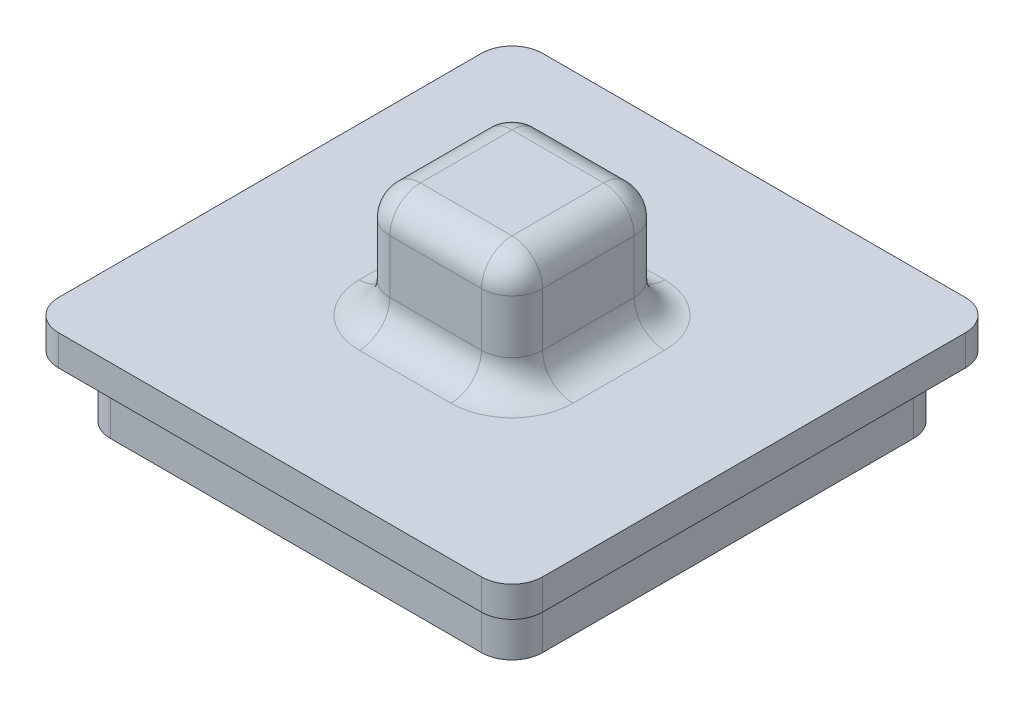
ISO-10303-21;
HEADER;
FILE_DESCRIPTION(('STEP AP214'),'2;1');
FILE_NAME('part.step','',(''),(''),'','','');
FILE_SCHEMA(('AUTOMOTIVE_DESIGN { 1 0 10303 214 1 1 1 1 }'));
ENDSEC;
DATA;
#1=APPLICATION_CONTEXT('core data for automotive mechanical design processes');
#2=APPLICATION_PROTOCOL_DEFINITION('international standard','automotive_design',2000,#1);
#3=PRODUCT_CONTEXT('',#1,'mechanical');
#4=PRODUCT('Part','Part','',(#3));
#5=PRODUCT_RELATED_PRODUCT_CATEGORY('part','',(#4));
#6=PRODUCT_DEFINITION_FORMATION('','',#4);
#7=PRODUCT_DEFINITION_CONTEXT('part definition',#1,'design');
#8=PRODUCT_DEFINITION('design','',#6,#7);
#9=PRODUCT_DEFINITION_SHAPE('','',#8);
#10=(LENGTH_UNIT() NAMED_UNIT(*) SI_UNIT(.MILLI.,.METRE.));
#11=(NAMED_UNIT(*) PLANE_ANGLE_UNIT() SI_UNIT($,.RADIAN.));
#12=(NAMED_UNIT(*) SI_UNIT($,.STERADIAN.) SOLID_ANGLE_UNIT());
#13=UNCERTAINTY_MEASURE_WITH_UNIT(LENGTH_MEASURE(1.E-05),#10,'distance_accuracy_value','');
#14=(GEOMETRIC_REPRESENTATION_CONTEXT(3) GLOBAL_UNCERTAINTY_ASSIGNED_CONTEXT((#13)) GLOBAL_UNIT_ASSIGNED_CONTEXT((#10,
#11,#12)) REPRESENTATION_CONTEXT('',''));
#15=CARTESIAN_POINT('',(0.,0.,0.));
#16=DIRECTION('',(0.,0.,1.));
#17=DIRECTION('',(1.,0.,0.));
#18=AXIS2_PLACEMENT_3D('',#15,#16,#17);
#19=CARTESIAN_POINT('',(0.,0.,0.));
#20=DIRECTION('',(0.,1.,0.));
#21=DIRECTION('',(0.,0.,1.));
#22=AXIS2_PLACEMENT_3D('',#19,#20,#21);
#23=PLANE('',#22);
#24=DIRECTION('',(1.,0.,0.));
#25=VECTOR('',#24,1.);
#26=CARTESIAN_POINT('',(-7.925,0.,7.925));
#27=LINE('',#26,#25);
#28=CARTESIAN_POINT('',(-6.925,0.,7.925));
#29=VERTEX_POINT('',#28);
#30=CARTESIAN_POINT('',(6.925,0.,7.925));
#31=VERTEX_POINT('',#30);
#32=EDGE_CURVE('E483',#29,#31,#27,.T.);
#33=ORIENTED_EDGE('',*,*,#32,.F.);
#34=CARTESIAN_POINT('',(-6.925,0.,6.925));
#35=DIRECTION('',(0.,1.,0.));
#36=DIRECTION('',(0.,0.,1.));
#37=AXIS2_PLACEMENT_3D('',#34,#35,#36);
#38=CIRCLE('',#37,1.);
#39=CARTESIAN_POINT('',(-7.925,0.,6.925));
#40=VERTEX_POINT('',#39);
#41=EDGE_CURVE('E377',#29,#40,#38,.F.);
#42=ORIENTED_EDGE('',*,*,#41,.T.);
#43=DIRECTION('',(0.,0.,1.));
#44=VECTOR('',#43,1.);
#45=CARTESIAN_POINT('',(-7.925,0.,-7.925));
#46=LINE('',#45,#44);
#47=CARTESIAN_POINT('',(-7.925,0.,-6.925));
#48=VERTEX_POINT('',#47);
#49=EDGE_CURVE('E496',#48,#40,#46,.T.);
#50=ORIENTED_EDGE('',*,*,#49,.F.);
#51=CARTESIAN_POINT('',(-6.925,0.,-6.925));
#52=DIRECTION('',(0.,1.,0.));
#53=DIRECTION('',(0.,0.,1.));
#54=AXIS2_PLACEMENT_3D('',#51,#52,#53);
#55=CIRCLE('',#54,1.);
#56=CARTESIAN_POINT('',(-6.925,0.,-7.925));
#57=VERTEX_POINT('',#56);
#58=EDGE_CURVE('E54',#48,#57,#55,.F.);
#59=ORIENTED_EDGE('',*,*,#58,.T.);
#60=DIRECTION('',(-1.,0.,0.));
#61=VECTOR('',#60,1.);
#62=CARTESIAN_POINT('',(-7.925,0.,-7.925));
#63=LINE('',#62,#61);
#64=CARTESIAN_POINT('',(6.925,0.,-7.925));
#65=VERTEX_POINT('',#64);
#66=EDGE_CURVE('E494',#65,#57,#63,.T.);
#67=ORIENTED_EDGE('',*,*,#66,.F.);
#68=CARTESIAN_POINT('',(6.925,0.,-6.925));
#69=DIRECTION('',(0.,1.,0.));
#70=DIRECTION('',(0.,0.,1.));
#71=AXIS2_PLACEMENT_3D('',#68,#69,#70);
#72=CIRCLE('',#71,1.);
#73=CARTESIAN_POINT('',(7.925,0.,-6.925));
#74=VERTEX_POINT('',#73);
#75=EDGE_CURVE('E62',#65,#74,#72,.F.);
#76=ORIENTED_EDGE('',*,*,#75,.T.);
#77=DIRECTION('',(0.,0.,-1.));
#78=VECTOR('',#77,1.);
#79=CARTESIAN_POINT('',(7.925,0.,-7.925));
#80=LINE('',#79,#78);
#81=CARTESIAN_POINT('',(7.925,0.,6.925));
#82=VERTEX_POINT('',#81);
#83=EDGE_CURVE('E491',#82,#74,#80,.T.);
#84=ORIENTED_EDGE('',*,*,#83,.F.);
#85=CARTESIAN_POINT('',(6.925,0.,6.925));
#86=DIRECTION('',(0.,1.,0.));
#87=DIRECTION('',(0.,0.,1.));
#88=AXIS2_PLACEMENT_3D('',#85,#86,#87);
#89=CIRCLE('',#88,1.);
#90=EDGE_CURVE('E373',#82,#31,#89,.F.);
#91=ORIENTED_EDGE('',*,*,#90,.T.);
#92=EDGE_LOOP('',(#33,#42,#50,#59,#67,#76,#84,#91));
#93=FACE_BOUND('',#92,.T.);
#94=DIRECTION('',(0.,0.,1.));
#95=VECTOR('',#94,1.);
#96=CARTESIAN_POINT('',(7.075,0.,7.075));
#97=LINE('',#96,#95);
#98=CARTESIAN_POINT('',(7.075,0.,-6.075));
#99=VERTEX_POINT('',#98);
#100=CARTESIAN_POINT('',(7.075,0.,6.075));
#101=VERTEX_POINT('',#100);
#102=EDGE_CURVE('E455',#99,#101,#97,.T.);
#103=ORIENTED_EDGE('',*,*,#102,.F.);
#104=CARTESIAN_POINT('',(6.075,0.,-6.075));
#105=DIRECTION('',(0.,1.,0.));
#106=DIRECTION('',(0.,0.,1.));
#107=AXIS2_PLACEMENT_3D('',#104,#105,#106);
#108=CIRCLE('',#107,1.);
#109=CARTESIAN_POINT('',(6.075,0.,-7.075));
#110=VERTEX_POINT('',#109);
#111=EDGE_CURVE('E395',#99,#110,#108,.T.);
#112=ORIENTED_EDGE('',*,*,#111,.T.);
#113=DIRECTION('',(1.,0.,0.));
#114=VECTOR('',#113,1.);
#115=CARTESIAN_POINT('',(-7.075,0.,-7.075));
#116=LINE('',#115,#114);
#117=CARTESIAN_POINT('',(-6.075,0.,-7.075));
#118=VERTEX_POINT('',#117);
#119=EDGE_CURVE('E475',#118,#110,#116,.T.);
#120=ORIENTED_EDGE('',*,*,#119,.F.);
#121=CARTESIAN_POINT('',(-6.075,0.,-6.075));
#122=DIRECTION('',(0.,1.,0.));
#123=DIRECTION('',(0.,0.,1.));
#124=AXIS2_PLACEMENT_3D('',#121,#122,#123);
#125=CIRCLE('',#124,1.);
#126=CARTESIAN_POINT('',(-7.075,0.,-6.075));
#127=VERTEX_POINT('',#126);
#128=EDGE_CURVE('E393',#118,#127,#125,.T.);
#129=ORIENTED_EDGE('',*,*,#128,.T.);
#130=DIRECTION('',(0.,0.,-1.));
#131=VECTOR('',#130,1.);
#132=CARTESIAN_POINT('',(-7.075,0.,7.075));
#133=LINE('',#132,#131);
#134=CARTESIAN_POINT('',(-7.075,0.,6.075));
#135=VERTEX_POINT('',#134);
#136=EDGE_CURVE('E467',#135,#127,#133,.T.);
#137=ORIENTED_EDGE('',*,*,#136,.F.);
#138=CARTESIAN_POINT('',(-6.075,0.,6.075));
#139=DIRECTION('',(0.,1.,0.));
#140=DIRECTION('',(0.,0.,1.));
#141=AXIS2_PLACEMENT_3D('',#138,#139,#140);
#142=CIRCLE('',#141,1.);
#143=CARTESIAN_POINT('',(-6.075,0.,7.075));
#144=VERTEX_POINT('',#143);
#145=EDGE_CURVE('E11',#135,#144,#142,.T.);
#146=ORIENTED_EDGE('',*,*,#145,.T.);
#147=DIRECTION('',(-1.,0.,0.));
#148=VECTOR('',#147,1.);
#149=CARTESIAN_POINT('',(-7.075,0.,7.075));
#150=LINE('',#149,#148);
#151=CARTESIAN_POINT('',(6.075,0.,7.075));
#152=VERTEX_POINT('',#151);
#153=EDGE_CURVE('E461',#152,#144,#150,.T.);
#154=ORIENTED_EDGE('',*,*,#153,.F.);
#155=CARTESIAN_POINT('',(6.075,0.,6.075));
#156=DIRECTION('',(0.,1.,0.));
#157=DIRECTION('',(0.,0.,1.));
#158=AXIS2_PLACEMENT_3D('',#155,#156,#157);
#159=CIRCLE('',#158,1.);
#160=EDGE_CURVE('E46',#152,#101,#159,.T.);
#161=ORIENTED_EDGE('',*,*,#160,.T.);
#162=EDGE_LOOP('',(#103,#112,#120,#129,#137,#146,#154,#161));
#163=FACE_BOUND('',#162,.T.);
#164=ADVANCED_FACE('F37',(#93,#163),#23,.F.);
#165=CARTESIAN_POINT('',(7.925,1.,-7.925));
#166=DIRECTION('',(-1.,0.,0.));
#167=DIRECTION('',(0.,0.,1.));
#168=AXIS2_PLACEMENT_3D('',#165,#166,#167);
#169=PLANE('',#168);
#170=ORIENTED_EDGE('',*,*,#83,.T.);
#171=DIRECTION('',(0.,-1.,0.));
#172=VECTOR('',#171,1.);
#173=CARTESIAN_POINT('',(7.925,1.,-6.925));
#174=LINE('',#173,#172);
#175=CARTESIAN_POINT('',(7.925,1.,-6.925));
#176=VERTEX_POINT('',#175);
#177=EDGE_CURVE('E391',#74,#176,#174,.F.);
#178=ORIENTED_EDGE('',*,*,#177,.T.);
#179=DIRECTION('',(0.,0.,-1.));
#180=VECTOR('',#179,1.);
#181=CARTESIAN_POINT('',(7.925,1.,-7.925));
#182=LINE('',#181,#180);
#183=CARTESIAN_POINT('',(7.925,1.,6.925));
#184=VERTEX_POINT('',#183);
#185=EDGE_CURVE('E479',#184,#176,#182,.T.);
#186=ORIENTED_EDGE('',*,*,#185,.F.);
#187=DIRECTION('',(0.,-1.,0.));
#188=VECTOR('',#187,1.);
#189=CARTESIAN_POINT('',(7.925,1.,6.925));
#190=LINE('',#189,#188);
#191=EDGE_CURVE('E388',#184,#82,#190,.T.);
#192=ORIENTED_EDGE('',*,*,#191,.T.);
#193=EDGE_LOOP('',(#170,#178,#186,#192));
#194=FACE_BOUND('',#193,.T.);
#195=ADVANCED_FACE('F548',(#194),#169,.F.);
#196=CARTESIAN_POINT('',(-7.925,1.,-7.925));
#197=DIRECTION('',(0.,0.,1.));
#198=DIRECTION('',(1.,0.,0.));
#199=AXIS2_PLACEMENT_3D('',#196,#197,#198);
#200=PLANE('',#199);
#201=ORIENTED_EDGE('',*,*,#66,.T.);
#202=DIRECTION('',(0.,-1.,0.));
#203=VECTOR('',#202,1.);
#204=CARTESIAN_POINT('',(-6.925,1.,-7.925));
#205=LINE('',#204,#203);
#206=CARTESIAN_POINT('',(-6.925,1.,-7.925));
#207=VERTEX_POINT('',#206);
#208=EDGE_CURVE('E386',#57,#207,#205,.F.);
#209=ORIENTED_EDGE('',*,*,#208,.T.);
#210=DIRECTION('',(-1.,0.,0.));
#211=VECTOR('',#210,1.);
#212=CARTESIAN_POINT('',(-7.925,1.,-7.925));
#213=LINE('',#212,#211);
#214=CARTESIAN_POINT('',(6.925,1.,-7.925));
#215=VERTEX_POINT('',#214);
#216=EDGE_CURVE('E482',#215,#207,#213,.T.);
#217=ORIENTED_EDGE('',*,*,#216,.F.);
#218=DIRECTION('',(0.,-1.,0.));
#219=VECTOR('',#218,1.);
#220=CARTESIAN_POINT('',(6.925,1.,-7.925));
#221=LINE('',#220,#219);
#222=EDGE_CURVE('E384',#215,#65,#221,.T.);
#223=ORIENTED_EDGE('',*,*,#222,.T.);
#224=EDGE_LOOP('',(#201,#209,#217,#223));
#225=FACE_BOUND('',#224,.T.);
#226=ADVANCED_FACE('F553',(#225),#200,.F.);
#227=CARTESIAN_POINT('',(-7.925,1.,-7.925));
#228=DIRECTION('',(1.,0.,0.));
#229=DIRECTION('',(0.,0.,-1.));
#230=AXIS2_PLACEMENT_3D('',#227,#228,#229);
#231=PLANE('',#230);
#232=ORIENTED_EDGE('',*,*,#49,.T.);
#233=DIRECTION('',(0.,-1.,0.));
#234=VECTOR('',#233,1.);
#235=CARTESIAN_POINT('',(-7.925,1.,6.925));
#236=LINE('',#235,#234);
#237=CARTESIAN_POINT('',(-7.925,1.,6.925));
#238=VERTEX_POINT('',#237);
#239=EDGE_CURVE('E382',#40,#238,#236,.F.);
#240=ORIENTED_EDGE('',*,*,#239,.T.);
#241=DIRECTION('',(0.,0.,1.));
#242=VECTOR('',#241,1.);
#243=CARTESIAN_POINT('',(-7.925,1.,-7.925));
#244=LINE('',#243,#242);
#245=CARTESIAN_POINT('',(-7.925,1.,-6.925));
#246=VERTEX_POINT('',#245);
#247=EDGE_CURVE('E486',#246,#238,#244,.T.);
#248=ORIENTED_EDGE('',*,*,#247,.F.);
#249=DIRECTION('',(0.,-1.,0.));
#250=VECTOR('',#249,1.);
#251=CARTESIAN_POINT('',(-7.925,1.,-6.925));
#252=LINE('',#251,#250);
#253=EDGE_CURVE('E379',#246,#48,#252,.T.);
#254=ORIENTED_EDGE('',*,*,#253,.T.);
#255=EDGE_LOOP('',(#232,#240,#248,#254));
#256=FACE_BOUND('',#255,.T.);
#257=ADVANCED_FACE('F564',(#256),#231,.F.);
#258=CARTESIAN_POINT('',(-7.925,1.,7.925));
#259=DIRECTION('',(0.,0.,-1.));
#260=DIRECTION('',(-1.,0.,0.));
#261=AXIS2_PLACEMENT_3D('',#258,#259,#260);
#262=PLANE('',#261);
#263=DIRECTION('',(1.,0.,0.));
#264=VECTOR('',#263,1.);
#265=CARTESIAN_POINT('',(-7.925,1.,7.925));
#266=LINE('',#265,#264);
#267=CARTESIAN_POINT('',(-6.925,1.,7.925));
#268=VERTEX_POINT('',#267);
#269=CARTESIAN_POINT('',(6.925,1.,7.925));
#270=VERTEX_POINT('',#269);
#271=EDGE_CURVE('E268',#268,#270,#266,.T.);
#272=ORIENTED_EDGE('',*,*,#271,.F.);
#273=DIRECTION('',(0.,-1.,0.));
#274=VECTOR('',#273,1.);
#275=CARTESIAN_POINT('',(-6.925,1.,7.925));
#276=LINE('',#275,#274);
#277=EDGE_CURVE('E370',#268,#29,#276,.T.);
#278=ORIENTED_EDGE('',*,*,#277,.T.);
#279=ORIENTED_EDGE('',*,*,#32,.T.);
#280=DIRECTION('',(0.,-1.,0.));
#281=VECTOR('',#280,1.);
#282=CARTESIAN_POINT('',(6.925,1.,7.925));
#283=LINE('',#282,#281);
#284=EDGE_CURVE('E368',#31,#270,#283,.F.);
#285=ORIENTED_EDGE('',*,*,#284,.T.);
#286=EDGE_LOOP('',(#272,#278,#279,#285));
#287=FACE_BOUND('',#286,.T.);
#288=ADVANCED_FACE('F561',(#287),#262,.F.);
#289=CARTESIAN_POINT('',(0.,1.,0.));
#290=DIRECTION('',(0.,1.,0.));
#291=DIRECTION('',(0.,0.,1.));
#292=AXIS2_PLACEMENT_3D('',#289,#290,#291);
#293=PLANE('',#292);
#294=CARTESIAN_POINT('',(-1.5,1.,-1.5));
#295=DIRECTION('',(0.,1.,0.));
#296=DIRECTION('',(0.,0.,1.));
#297=AXIS2_PLACEMENT_3D('',#294,#295,#296);
#298=CIRCLE('',#297,2.);
#299=CARTESIAN_POINT('',(-1.5,1.,-3.5));
#300=VERTEX_POINT('',#299);
#301=CARTESIAN_POINT('',(-3.5,1.,-1.5));
#302=VERTEX_POINT('',#301);
#303=EDGE_CURVE('E286',#300,#302,#298,.T.);
#304=ORIENTED_EDGE('',*,*,#303,.F.);
#305=DIRECTION('',(-1.,0.,0.));
#306=VECTOR('',#305,1.);
#307=CARTESIAN_POINT('',(0.,1.,-3.5));
#308=LINE('',#307,#306);
#309=CARTESIAN_POINT('',(1.5,1.,-3.5));
#310=VERTEX_POINT('',#309);
#311=EDGE_CURVE('E244',#300,#310,#308,.F.);
#312=ORIENTED_EDGE('',*,*,#311,.T.);
#313=CARTESIAN_POINT('',(1.5,1.,-1.5));
#314=DIRECTION('',(0.,1.,0.));
#315=DIRECTION('',(0.,0.,1.));
#316=AXIS2_PLACEMENT_3D('',#313,#314,#315);
#317=CIRCLE('',#316,2.);
#318=CARTESIAN_POINT('',(3.5,1.,-1.5));
#319=VERTEX_POINT('',#318);
#320=EDGE_CURVE('E300',#319,#310,#317,.T.);
#321=ORIENTED_EDGE('',*,*,#320,.F.);
#322=DIRECTION('',(0.,0.,-1.));
#323=VECTOR('',#322,1.);
#324=CARTESIAN_POINT('',(3.5,1.,0.));
#325=LINE('',#324,#323);
#326=CARTESIAN_POINT('',(3.5,1.,1.5));
#327=VERTEX_POINT('',#326);
#328=EDGE_CURVE('E298',#319,#327,#325,.F.);
#329=ORIENTED_EDGE('',*,*,#328,.T.);
#330=CARTESIAN_POINT('',(1.5,1.,1.5));
#331=DIRECTION('',(0.,1.,0.));
#332=DIRECTION('',(0.,0.,1.));
#333=AXIS2_PLACEMENT_3D('',#330,#331,#332);
#334=CIRCLE('',#333,2.);
#335=CARTESIAN_POINT('',(1.5,1.,3.5));
#336=VERTEX_POINT('',#335);
#337=EDGE_CURVE('E295',#336,#327,#334,.T.);
#338=ORIENTED_EDGE('',*,*,#337,.F.);
#339=DIRECTION('',(1.,0.,0.));
#340=VECTOR('',#339,1.);
#341=CARTESIAN_POINT('',(0.,1.,3.5));
#342=LINE('',#341,#340);
#343=CARTESIAN_POINT('',(-1.5,1.,3.5));
#344=VERTEX_POINT('',#343);
#345=EDGE_CURVE('E293',#336,#344,#342,.F.);
#346=ORIENTED_EDGE('',*,*,#345,.T.);
#347=CARTESIAN_POINT('',(-1.5,1.,1.5));
#348=DIRECTION('',(0.,1.,0.));
#349=DIRECTION('',(0.,0.,1.));
#350=AXIS2_PLACEMENT_3D('',#347,#348,#349);
#351=CIRCLE('',#350,2.);
#352=CARTESIAN_POINT('',(-3.5,1.,1.5));
#353=VERTEX_POINT('',#352);
#354=EDGE_CURVE('E290',#353,#344,#351,.T.);
#355=ORIENTED_EDGE('',*,*,#354,.F.);
#356=DIRECTION('',(0.,0.,1.));
#357=VECTOR('',#356,1.);
#358=CARTESIAN_POINT('',(-3.5,1.,0.));
#359=LINE('',#358,#357);
#360=EDGE_CURVE('E288',#353,#302,#359,.F.);
#361=ORIENTED_EDGE('',*,*,#360,.T.);
#362=EDGE_LOOP('',(#304,#312,#321,#329,#338,#346,#355,#361));
#363=FACE_BOUND('',#362,.T.);
#364=ORIENTED_EDGE('',*,*,#247,.T.);
#365=CARTESIAN_POINT('',(-6.925,1.,6.925));
#366=DIRECTION('',(0.,1.,0.));
#367=DIRECTION('',(0.,0.,1.));
#368=AXIS2_PLACEMENT_3D('',#365,#366,#367);
#369=CIRCLE('',#368,1.);
#370=EDGE_CURVE('E284',#238,#268,#369,.T.);
#371=ORIENTED_EDGE('',*,*,#370,.T.);
#372=ORIENTED_EDGE('',*,*,#271,.T.);
#373=CARTESIAN_POINT('',(6.925,1.,6.925));
#374=DIRECTION('',(0.,1.,0.));
#375=DIRECTION('',(0.,0.,1.));
#376=AXIS2_PLACEMENT_3D('',#373,#374,#375);
#377=CIRCLE('',#376,1.);
#378=EDGE_CURVE('E274',#270,#184,#377,.T.);
#379=ORIENTED_EDGE('',*,*,#378,.T.);
#380=ORIENTED_EDGE('',*,*,#185,.T.);
#381=CARTESIAN_POINT('',(6.925,1.,-6.925));
#382=DIRECTION('',(0.,1.,0.));
#383=DIRECTION('',(0.,0.,1.));
#384=AXIS2_PLACEMENT_3D('',#381,#382,#383);
#385=CIRCLE('',#384,1.);
#386=EDGE_CURVE('E276',#176,#215,#385,.T.);
#387=ORIENTED_EDGE('',*,*,#386,.T.);
#388=ORIENTED_EDGE('',*,*,#216,.T.);
#389=CARTESIAN_POINT('',(-6.925,1.,-6.925));
#390=DIRECTION('',(0.,1.,0.));
#391=DIRECTION('',(0.,0.,1.));
#392=AXIS2_PLACEMENT_3D('',#389,#390,#391);
#393=CIRCLE('',#392,1.);
#394=EDGE_CURVE('E282',#207,#246,#393,.T.);
#395=ORIENTED_EDGE('',*,*,#394,.T.);
#396=EDGE_LOOP('',(#364,#371,#372,#379,#380,#387,#388,#395));
#397=FACE_BOUND('',#396,.T.);
#398=ADVANCED_FACE('F519',(#363,#397),#293,.T.);
#399=CARTESIAN_POINT('',(7.075,-2.,7.075));
#400=DIRECTION('',(-1.,0.,0.));
#401=DIRECTION('',(0.,0.,1.));
#402=AXIS2_PLACEMENT_3D('',#399,#400,#401);
#403=PLANE('',#402);
#404=DIRECTION('',(0.,0.,1.));
#405=VECTOR('',#404,1.);
#406=CARTESIAN_POINT('',(7.075,-2.,7.075));
#407=LINE('',#406,#405);
#408=CARTESIAN_POINT('',(7.075,-2.,-6.075));
#409=VERTEX_POINT('',#408);
#410=CARTESIAN_POINT('',(7.075,-2.,6.075));
#411=VERTEX_POINT('',#410);
#412=EDGE_CURVE('E478',#409,#411,#407,.T.);
#413=ORIENTED_EDGE('',*,*,#412,.F.);
#414=DIRECTION('',(0.,1.,0.));
#415=VECTOR('',#414,1.);
#416=CARTESIAN_POINT('',(7.075,-2.,-6.075));
#417=LINE('',#416,#415);
#418=EDGE_CURVE('E360',#409,#99,#417,.T.);
#419=ORIENTED_EDGE('',*,*,#418,.T.);
#420=ORIENTED_EDGE('',*,*,#102,.T.);
#421=DIRECTION('',(0.,1.,0.));
#422=VECTOR('',#421,1.);
#423=CARTESIAN_POINT('',(7.075,-2.,6.075));
#424=LINE('',#423,#422);
#425=EDGE_CURVE('E358',#101,#411,#424,.F.);
#426=ORIENTED_EDGE('',*,*,#425,.T.);
#427=EDGE_LOOP('',(#413,#419,#420,#426));
#428=FACE_BOUND('',#427,.T.);
#429=ADVANCED_FACE('F666',(#428),#403,.F.);
#430=CARTESIAN_POINT('',(-7.075,-2.,7.075));
#431=DIRECTION('',(0.,0.,-1.));
#432=DIRECTION('',(-1.,0.,0.));
#433=AXIS2_PLACEMENT_3D('',#430,#431,#432);
#434=PLANE('',#433);
#435=DIRECTION('',(-1.,0.,0.));
#436=VECTOR('',#435,1.);
#437=CARTESIAN_POINT('',(-7.075,-2.,7.075));
#438=LINE('',#437,#436);
#439=CARTESIAN_POINT('',(6.075,-2.,7.075));
#440=VERTEX_POINT('',#439);
#441=CARTESIAN_POINT('',(-6.075,-2.,7.075));
#442=VERTEX_POINT('',#441);
#443=EDGE_CURVE('E1068',#440,#442,#438,.T.);
#444=ORIENTED_EDGE('',*,*,#443,.F.);
#445=DIRECTION('',(0.,1.,0.));
#446=VECTOR('',#445,1.);
#447=CARTESIAN_POINT('',(6.075,-2.,7.075));
#448=LINE('',#447,#446);
#449=EDGE_CURVE('E365',#440,#152,#448,.T.);
#450=ORIENTED_EDGE('',*,*,#449,.T.);
#451=ORIENTED_EDGE('',*,*,#153,.T.);
#452=DIRECTION('',(0.,1.,0.));
#453=VECTOR('',#452,1.);
#454=CARTESIAN_POINT('',(-6.075,-2.,7.075));
#455=LINE('',#454,#453);
#456=EDGE_CURVE('E363',#144,#442,#455,.F.);
#457=ORIENTED_EDGE('',*,*,#456,.T.);
#458=EDGE_LOOP('',(#444,#450,#451,#457));
#459=FACE_BOUND('',#458,.T.);
#460=ADVANCED_FACE('F670',(#459),#434,.F.);
#461=CARTESIAN_POINT('',(-7.075,-2.,7.075));
#462=DIRECTION('',(1.,0.,0.));
#463=DIRECTION('',(0.,0.,-1.));
#464=AXIS2_PLACEMENT_3D('',#461,#462,#463);
#465=PLANE('',#464);
#466=ORIENTED_EDGE('',*,*,#136,.T.);
#467=DIRECTION('',(0.,1.,0.));
#468=VECTOR('',#467,1.);
#469=CARTESIAN_POINT('',(-7.075,-2.,-6.075));
#470=LINE('',#469,#468);
#471=CARTESIAN_POINT('',(-7.075,-2.,-6.075));
#472=VERTEX_POINT('',#471);
#473=EDGE_CURVE('E348',#127,#472,#470,.F.);
#474=ORIENTED_EDGE('',*,*,#473,.T.);
#475=DIRECTION('',(0.,0.,-1.));
#476=VECTOR('',#475,1.);
#477=CARTESIAN_POINT('',(-7.075,-2.,7.075));
#478=LINE('',#477,#476);
#479=CARTESIAN_POINT('',(-7.075,-2.,6.075));
#480=VERTEX_POINT('',#479);
#481=EDGE_CURVE('E1061',#480,#472,#478,.T.);
#482=ORIENTED_EDGE('',*,*,#481,.F.);
#483=DIRECTION('',(0.,1.,0.));
#484=VECTOR('',#483,1.);
#485=CARTESIAN_POINT('',(-7.075,-2.,6.075));
#486=LINE('',#485,#484);
#487=EDGE_CURVE('E345',#480,#135,#486,.T.);
#488=ORIENTED_EDGE('',*,*,#487,.T.);
#489=EDGE_LOOP('',(#466,#474,#482,#488));
#490=FACE_BOUND('',#489,.T.);
#491=ADVANCED_FACE('F674',(#490),#465,.F.);
#492=CARTESIAN_POINT('',(-7.075,-2.,-7.075));
#493=DIRECTION('',(0.,0.,1.));
#494=DIRECTION('',(1.,0.,0.));
#495=AXIS2_PLACEMENT_3D('',#492,#493,#494);
#496=PLANE('',#495);
#497=DIRECTION('',(1.,0.,0.));
#498=VECTOR('',#497,1.);
#499=CARTESIAN_POINT('',(-7.075,-2.,-7.075));
#500=LINE('',#499,#498);
#501=CARTESIAN_POINT('',(-6.075,-2.,-7.075));
#502=VERTEX_POINT('',#501);
#503=CARTESIAN_POINT('',(6.075,-2.,-7.075));
#504=VERTEX_POINT('',#503);
#505=EDGE_CURVE('E470',#502,#504,#500,.T.);
#506=ORIENTED_EDGE('',*,*,#505,.F.);
#507=DIRECTION('',(0.,1.,0.));
#508=VECTOR('',#507,1.);
#509=CARTESIAN_POINT('',(-6.075,-2.,-7.075));
#510=LINE('',#509,#508);
#511=EDGE_CURVE('E342',#502,#118,#510,.T.);
#512=ORIENTED_EDGE('',*,*,#511,.T.);
#513=ORIENTED_EDGE('',*,*,#119,.T.);
#514=DIRECTION('',(0.,1.,0.));
#515=VECTOR('',#514,1.);
#516=CARTESIAN_POINT('',(6.075,-2.,-7.075));
#517=LINE('',#516,#515);
#518=EDGE_CURVE('E340',#110,#504,#517,.F.);
#519=ORIENTED_EDGE('',*,*,#518,.T.);
#520=EDGE_LOOP('',(#506,#512,#513,#519));
#521=FACE_BOUND('',#520,.T.);
#522=ADVANCED_FACE('F681',(#521),#496,.F.);
#523=CARTESIAN_POINT('',(0.,-2.,0.));
#524=DIRECTION('',(0.,-1.,0.));
#525=DIRECTION('',(0.,0.,-1.));
#526=AXIS2_PLACEMENT_3D('',#523,#524,#525);
#527=PLANE('',#526);
#528=ORIENTED_EDGE('',*,*,#481,.T.);
#529=CARTESIAN_POINT('',(-6.075,-2.,-6.075));
#530=DIRECTION('',(0.,-1.,0.));
#531=DIRECTION('',(0.,0.,-1.));
#532=AXIS2_PLACEMENT_3D('',#529,#530,#531);
#533=CIRCLE('',#532,1.);
#534=EDGE_CURVE('E356',#472,#502,#533,.T.);
#535=ORIENTED_EDGE('',*,*,#534,.T.);
#536=ORIENTED_EDGE('',*,*,#505,.T.);
#537=CARTESIAN_POINT('',(6.075,-2.,-6.075));
#538=DIRECTION('',(0.,-1.,0.));
#539=DIRECTION('',(0.,0.,-1.));
#540=AXIS2_PLACEMENT_3D('',#537,#538,#539);
#541=CIRCLE('',#540,1.);
#542=EDGE_CURVE('E354',#504,#409,#541,.T.);
#543=ORIENTED_EDGE('',*,*,#542,.T.);
#544=ORIENTED_EDGE('',*,*,#412,.T.);
#545=CARTESIAN_POINT('',(6.075,-2.,6.075));
#546=DIRECTION('',(0.,-1.,0.));
#547=DIRECTION('',(0.,0.,-1.));
#548=AXIS2_PLACEMENT_3D('',#545,#546,#547);
#549=CIRCLE('',#548,1.);
#550=EDGE_CURVE('E352',#411,#440,#549,.T.);
#551=ORIENTED_EDGE('',*,*,#550,.T.);
#552=ORIENTED_EDGE('',*,*,#443,.T.);
#553=CARTESIAN_POINT('',(-6.075,-2.,6.075));
#554=DIRECTION('',(0.,-1.,0.));
#555=DIRECTION('',(0.,0.,-1.));
#556=AXIS2_PLACEMENT_3D('',#553,#554,#555);
#557=CIRCLE('',#556,1.);
#558=EDGE_CURVE('E350',#442,#480,#557,.T.);
#559=ORIENTED_EDGE('',*,*,#558,.T.);
#560=EDGE_LOOP('',(#528,#535,#536,#543,#544,#551,#552,#559));
#561=FACE_BOUND('',#560,.T.);
#562=ADVANCED_FACE('F685',(#561),#527,.T.);
#563=CARTESIAN_POINT('',(2.5,4.75,-2.5));
#564=DIRECTION('',(-1.,0.,0.));
#565=DIRECTION('',(0.,0.,1.));
#566=AXIS2_PLACEMENT_3D('',#563,#564,#565);
#567=PLANE('',#566);
#568=DIRECTION('',(0.,0.,-1.));
#569=VECTOR('',#568,1.);
#570=CARTESIAN_POINT('',(2.5,2.,-2.5));
#571=LINE('',#570,#569);
#572=CARTESIAN_POINT('',(2.5,2.,1.5));
#573=VERTEX_POINT('',#572);
#574=CARTESIAN_POINT('',(2.5,2.,-1.5));
#575=VERTEX_POINT('',#574);
#576=EDGE_CURVE('E308',#573,#575,#571,.T.);
#577=ORIENTED_EDGE('',*,*,#576,.T.);
#578=DIRECTION('',(0.,-1.,0.));
#579=VECTOR('',#578,1.);
#580=CARTESIAN_POINT('',(2.5,4.75,-1.5));
#581=LINE('',#580,#579);
#582=CARTESIAN_POINT('',(2.5,3.75,-1.5));
#583=VERTEX_POINT('',#582);
#584=EDGE_CURVE('E310',#575,#583,#581,.F.);
#585=ORIENTED_EDGE('',*,*,#584,.T.);
#586=DIRECTION('',(0.,0.,-1.));
#587=VECTOR('',#586,1.);
#588=CARTESIAN_POINT('',(2.5,3.75,2.5));
#589=LINE('',#588,#587);
#590=CARTESIAN_POINT('',(2.5,3.75,1.5));
#591=VERTEX_POINT('',#590);
#592=EDGE_CURVE('E306',#583,#591,#589,.F.);
#593=ORIENTED_EDGE('',*,*,#592,.T.);
#594=DIRECTION('',(0.,-1.,0.));
#595=VECTOR('',#594,1.);
#596=CARTESIAN_POINT('',(2.5,4.75,1.5));
#597=LINE('',#596,#595);
#598=EDGE_CURVE('E304',#591,#573,#597,.T.);
#599=ORIENTED_EDGE('',*,*,#598,.T.);
#600=EDGE_LOOP('',(#577,#585,#593,#599));
#601=FACE_BOUND('',#600,.T.);
#602=ADVANCED_FACE('F689',(#601),#567,.F.);
#603=CARTESIAN_POINT('',(-2.5,4.75,-2.5));
#604=DIRECTION('',(0.,0.,1.));
#605=DIRECTION('',(1.,0.,0.));
#606=AXIS2_PLACEMENT_3D('',#603,#604,#605);
#607=PLANE('',#606);
#608=DIRECTION('',(0.,-1.,0.));
#609=VECTOR('',#608,1.);
#610=CARTESIAN_POINT('',(1.5,4.75,-2.5));
#611=LINE('',#610,#609);
#612=CARTESIAN_POINT('',(1.5,3.75,-2.5));
#613=VERTEX_POINT('',#612);
#614=CARTESIAN_POINT('',(1.5,2.,-2.5));
#615=VERTEX_POINT('',#614);
#616=EDGE_CURVE('E272',#613,#615,#611,.T.);
#617=ORIENTED_EDGE('',*,*,#616,.T.);
#618=DIRECTION('',(-1.,0.,0.));
#619=VECTOR('',#618,1.);
#620=CARTESIAN_POINT('',(-2.5,2.,-2.5));
#621=LINE('',#620,#619);
#622=CARTESIAN_POINT('',(-1.5,2.,-2.5));
#623=VERTEX_POINT('',#622);
#624=EDGE_CURVE('E242',#615,#623,#621,.T.);
#625=ORIENTED_EDGE('',*,*,#624,.T.);
#626=DIRECTION('',(0.,-1.,0.));
#627=VECTOR('',#626,1.);
#628=CARTESIAN_POINT('',(-1.5,4.75,-2.5));
#629=LINE('',#628,#627);
#630=CARTESIAN_POINT('',(-1.5,3.75,-2.5));
#631=VERTEX_POINT('',#630);
#632=EDGE_CURVE('E261',#623,#631,#629,.F.);
#633=ORIENTED_EDGE('',*,*,#632,.T.);
#634=DIRECTION('',(-1.,0.,0.));
#635=VECTOR('',#634,1.);
#636=CARTESIAN_POINT('',(2.5,3.75,-2.5));
#637=LINE('',#636,#635);
#638=EDGE_CURVE('E267',#631,#613,#637,.F.);
#639=ORIENTED_EDGE('',*,*,#638,.T.);
#640=EDGE_LOOP('',(#617,#625,#633,#639));
#641=FACE_BOUND('',#640,.T.);
#642=ADVANCED_FACE('F270',(#641),#607,.F.);
#643=CARTESIAN_POINT('',(-2.5,4.75,-2.5));
#644=DIRECTION('',(1.,0.,0.));
#645=DIRECTION('',(0.,0.,-1.));
#646=AXIS2_PLACEMENT_3D('',#643,#644,#645);
#647=PLANE('',#646);
#648=DIRECTION('',(0.,0.,1.));
#649=VECTOR('',#648,1.);
#650=CARTESIAN_POINT('',(-2.5,3.75,-2.5));
#651=LINE('',#650,#649);
#652=CARTESIAN_POINT('',(-2.5,3.75,1.5));
#653=VERTEX_POINT('',#652);
#654=CARTESIAN_POINT('',(-2.5,3.75,-1.5));
#655=VERTEX_POINT('',#654);
#656=EDGE_CURVE('E335',#653,#655,#651,.F.);
#657=ORIENTED_EDGE('',*,*,#656,.T.);
#658=DIRECTION('',(0.,-1.,0.));
#659=VECTOR('',#658,1.);
#660=CARTESIAN_POINT('',(-2.5,4.75,-1.5));
#661=LINE('',#660,#659);
#662=CARTESIAN_POINT('',(-2.5,2.,-1.5));
#663=VERTEX_POINT('',#662);
#664=EDGE_CURVE('E337',#655,#663,#661,.T.);
#665=ORIENTED_EDGE('',*,*,#664,.T.);
#666=DIRECTION('',(0.,0.,1.));
#667=VECTOR('',#666,1.);
#668=CARTESIAN_POINT('',(-2.5,2.,-2.5));
#669=LINE('',#668,#667);
#670=CARTESIAN_POINT('',(-2.5,2.,1.5));
#671=VERTEX_POINT('',#670);
#672=EDGE_CURVE('E331',#663,#671,#669,.T.);
#673=ORIENTED_EDGE('',*,*,#672,.T.);
#674=DIRECTION('',(0.,-1.,0.));
#675=VECTOR('',#674,1.);
#676=CARTESIAN_POINT('',(-2.5,4.75,1.5));
#677=LINE('',#676,#675);
#678=EDGE_CURVE('E333',#671,#653,#677,.F.);
#679=ORIENTED_EDGE('',*,*,#678,.T.);
#680=EDGE_LOOP('',(#657,#665,#673,#679));
#681=FACE_BOUND('',#680,.T.);
#682=ADVANCED_FACE('F527',(#681),#647,.F.);
#683=CARTESIAN_POINT('',(-2.5,4.75,2.5));
#684=DIRECTION('',(0.,0.,-1.));
#685=DIRECTION('',(-1.,0.,0.));
#686=AXIS2_PLACEMENT_3D('',#683,#684,#685);
#687=PLANE('',#686);
#688=DIRECTION('',(0.,-1.,0.));
#689=VECTOR('',#688,1.);
#690=CARTESIAN_POINT('',(1.5,4.75,2.5));
#691=LINE('',#690,#689);
#692=CARTESIAN_POINT('',(1.5,2.,2.5));
#693=VERTEX_POINT('',#692);
#694=CARTESIAN_POINT('',(1.5,3.75,2.5));
#695=VERTEX_POINT('',#694);
#696=EDGE_CURVE('E326',#693,#695,#691,.F.);
#697=ORIENTED_EDGE('',*,*,#696,.T.);
#698=DIRECTION('',(1.,0.,0.));
#699=VECTOR('',#698,1.);
#700=CARTESIAN_POINT('',(-2.5,3.75,2.5));
#701=LINE('',#700,#699);
#702=CARTESIAN_POINT('',(-1.5,3.75,2.5));
#703=VERTEX_POINT('',#702);
#704=EDGE_CURVE('E328',#695,#703,#701,.F.);
#705=ORIENTED_EDGE('',*,*,#704,.T.);
#706=DIRECTION('',(0.,-1.,0.));
#707=VECTOR('',#706,1.);
#708=CARTESIAN_POINT('',(-1.5,4.75,2.5));
#709=LINE('',#708,#707);
#710=CARTESIAN_POINT('',(-1.5,2.,2.5));
#711=VERTEX_POINT('',#710);
#712=EDGE_CURVE('E322',#703,#711,#709,.T.);
#713=ORIENTED_EDGE('',*,*,#712,.T.);
#714=DIRECTION('',(1.,0.,0.));
#715=VECTOR('',#714,1.);
#716=CARTESIAN_POINT('',(-2.5,2.,2.5));
#717=LINE('',#716,#715);
#718=EDGE_CURVE('E324',#711,#693,#717,.T.);
#719=ORIENTED_EDGE('',*,*,#718,.T.);
#720=EDGE_LOOP('',(#697,#705,#713,#719));
#721=FACE_BOUND('',#720,.T.);
#722=ADVANCED_FACE('F698',(#721),#687,.F.);
#723=CARTESIAN_POINT('',(0.,4.75,0.));
#724=DIRECTION('',(0.,1.,0.));
#725=DIRECTION('',(0.,0.,1.));
#726=AXIS2_PLACEMENT_3D('',#723,#724,#725);
#727=PLANE('',#726);
#728=DIRECTION('',(0.,0.,-1.));
#729=VECTOR('',#728,1.);
#730=CARTESIAN_POINT('',(1.5,4.75,-2.5));
#731=LINE('',#730,#729);
#732=CARTESIAN_POINT('',(1.5,4.75,1.5));
#733=VERTEX_POINT('',#732);
#734=CARTESIAN_POINT('',(1.5,4.75,-1.5));
#735=VERTEX_POINT('',#734);
#736=EDGE_CURVE('E317',#733,#735,#731,.T.);
#737=ORIENTED_EDGE('',*,*,#736,.T.);
#738=DIRECTION('',(-1.,0.,0.));
#739=VECTOR('',#738,1.);
#740=CARTESIAN_POINT('',(-2.5,4.75,-1.5));
#741=LINE('',#740,#739);
#742=CARTESIAN_POINT('',(-1.5,4.75,-1.5));
#743=VERTEX_POINT('',#742);
#744=EDGE_CURVE('E319',#735,#743,#741,.T.);
#745=ORIENTED_EDGE('',*,*,#744,.T.);
#746=DIRECTION('',(0.,0.,1.));
#747=VECTOR('',#746,1.);
#748=CARTESIAN_POINT('',(-1.5,4.75,2.5));
#749=LINE('',#748,#747);
#750=CARTESIAN_POINT('',(-1.5,4.75,1.5));
#751=VERTEX_POINT('',#750);
#752=EDGE_CURVE('E313',#743,#751,#749,.T.);
#753=ORIENTED_EDGE('',*,*,#752,.T.);
#754=DIRECTION('',(1.,0.,0.));
#755=VECTOR('',#754,1.);
#756=CARTESIAN_POINT('',(2.5,4.75,1.5));
#757=LINE('',#756,#755);
#758=EDGE_CURVE('E315',#751,#733,#757,.T.);
#759=ORIENTED_EDGE('',*,*,#758,.T.);
#760=EDGE_LOOP('',(#737,#745,#753,#759));
#761=FACE_BOUND('',#760,.T.);
#762=ADVANCED_FACE('F620',(#761),#727,.T.);
#763=CARTESIAN_POINT('',(0.,3.75,1.5));
#764=DIRECTION('',(-1.,0.,0.));
#765=DIRECTION('',(0.,0.,1.));
#766=AXIS2_PLACEMENT_3D('',#763,#764,#765);
#767=CYLINDRICAL_SURFACE('',#766,1.);
#768=CARTESIAN_POINT('',(1.5,3.75,1.5));
#769=DIRECTION('',(1.,0.,0.));
#770=DIRECTION('',(0.,0.,-1.));
#771=AXIS2_PLACEMENT_3D('',#768,#769,#770);
#772=CIRCLE('',#771,1.);
#773=EDGE_CURVE('E41',#733,#695,#772,.T.);
#774=ORIENTED_EDGE('',*,*,#773,.F.);
#775=ORIENTED_EDGE('',*,*,#758,.F.);
#776=CARTESIAN_POINT('',(-1.5,3.75,1.5));
#777=DIRECTION('',(-1.,0.,0.));
#778=DIRECTION('',(0.,0.,1.));
#779=AXIS2_PLACEMENT_3D('',#776,#777,#778);
#780=CIRCLE('',#779,1.);
#781=EDGE_CURVE('E448',#703,#751,#780,.T.);
#782=ORIENTED_EDGE('',*,*,#781,.F.);
#783=ORIENTED_EDGE('',*,*,#704,.F.);
#784=EDGE_LOOP('',(#774,#775,#782,#783));
#785=FACE_BOUND('',#784,.T.);
#786=ADVANCED_FACE('F614',(#785),#767,.T.);
#787=CARTESIAN_POINT('',(1.5,3.75,1.5));
#788=DIRECTION('',(0.,0.,1.));
#789=DIRECTION('',(1.,0.,0.));
#790=AXIS2_PLACEMENT_3D('',#787,#788,#789);
#791=SPHERICAL_SURFACE('',#790,1.);
#792=CARTESIAN_POINT('',(1.5,3.75,1.5));
#793=DIRECTION('',(0.,0.,1.));
#794=DIRECTION('',(1.,0.,0.));
#795=AXIS2_PLACEMENT_3D('',#792,#793,#794);
#796=CIRCLE('',#795,1.);
#797=EDGE_CURVE('E443',#733,#591,#796,.F.);
#798=ORIENTED_EDGE('',*,*,#797,.F.);
#799=ORIENTED_EDGE('',*,*,#773,.T.);
#800=CARTESIAN_POINT('',(1.5,3.75,1.5));
#801=DIRECTION('',(0.,1.,0.));
#802=DIRECTION('',(0.,0.,1.));
#803=AXIS2_PLACEMENT_3D('',#800,#801,#802);
#804=CIRCLE('',#803,1.);
#805=EDGE_CURVE('E446',#591,#695,#804,.F.);
#806=ORIENTED_EDGE('',*,*,#805,.F.);
#807=EDGE_LOOP('',(#798,#799,#806));
#808=FACE_BOUND('',#807,.T.);
#809=ADVANCED_FACE('F605',(#808),#791,.T.);
#810=CARTESIAN_POINT('',(-1.5,3.75,1.5));
#811=DIRECTION('',(0.,1.,0.));
#812=DIRECTION('',(0.,0.,1.));
#813=AXIS2_PLACEMENT_3D('',#810,#811,#812);
#814=SPHERICAL_SURFACE('',#813,1.);
#815=CARTESIAN_POINT('',(-1.5,3.75,1.5));
#816=DIRECTION('',(0.,1.,0.));
#817=DIRECTION('',(0.,0.,1.));
#818=AXIS2_PLACEMENT_3D('',#815,#816,#817);
#819=CIRCLE('',#818,1.);
#820=EDGE_CURVE('E437',#703,#653,#819,.F.);
#821=ORIENTED_EDGE('',*,*,#820,.F.);
#822=ORIENTED_EDGE('',*,*,#781,.T.);
#823=CARTESIAN_POINT('',(-1.5,3.75,1.5));
#824=DIRECTION('',(0.,0.,1.));
#825=DIRECTION('',(1.,0.,0.));
#826=AXIS2_PLACEMENT_3D('',#823,#824,#825);
#827=CIRCLE('',#826,1.);
#828=EDGE_CURVE('E440',#653,#751,#827,.F.);
#829=ORIENTED_EDGE('',*,*,#828,.F.);
#830=EDGE_LOOP('',(#821,#822,#829));
#831=FACE_BOUND('',#830,.T.);
#832=ADVANCED_FACE('F602',(#831),#814,.T.);
#833=CARTESIAN_POINT('',(1.5,4.75,1.5));
#834=DIRECTION('',(0.,-1.,0.));
#835=DIRECTION('',(0.,0.,-1.));
#836=AXIS2_PLACEMENT_3D('',#833,#834,#835);
#837=CYLINDRICAL_SURFACE('',#836,1.);
#838=ORIENTED_EDGE('',*,*,#805,.T.);
#839=ORIENTED_EDGE('',*,*,#696,.F.);
#840=CARTESIAN_POINT('',(1.5,2.,1.5));
#841=DIRECTION('',(0.,1.,0.));
#842=DIRECTION('',(0.,0.,1.));
#843=AXIS2_PLACEMENT_3D('',#840,#841,#842);
#844=CIRCLE('',#843,1.);
#845=EDGE_CURVE('E431',#573,#693,#844,.F.);
#846=ORIENTED_EDGE('',*,*,#845,.F.);
#847=ORIENTED_EDGE('',*,*,#598,.F.);
#848=EDGE_LOOP('',(#838,#839,#846,#847));
#849=FACE_BOUND('',#848,.T.);
#850=ADVANCED_FACE('F604',(#849),#837,.T.);
#851=CARTESIAN_POINT('',(1.5,3.75,0.));
#852=DIRECTION('',(0.,0.,1.));
#853=DIRECTION('',(1.,0.,0.));
#854=AXIS2_PLACEMENT_3D('',#851,#852,#853);
#855=CYLINDRICAL_SURFACE('',#854,1.);
#856=ORIENTED_EDGE('',*,*,#797,.T.);
#857=ORIENTED_EDGE('',*,*,#592,.F.);
#858=CARTESIAN_POINT('',(1.5,3.75,-1.5));
#859=DIRECTION('',(0.,0.,-1.));
#860=DIRECTION('',(-1.,0.,0.));
#861=AXIS2_PLACEMENT_3D('',#858,#859,#860);
#862=CIRCLE('',#861,1.);
#863=EDGE_CURVE('E428',#735,#583,#862,.T.);
#864=ORIENTED_EDGE('',*,*,#863,.F.);
#865=ORIENTED_EDGE('',*,*,#736,.F.);
#866=EDGE_LOOP('',(#856,#857,#864,#865));
#867=FACE_BOUND('',#866,.T.);
#868=ADVANCED_FACE('F611',(#867),#855,.T.);
#869=CARTESIAN_POINT('',(0.,3.75,-1.5));
#870=DIRECTION('',(1.,0.,0.));
#871=DIRECTION('',(0.,0.,-1.));
#872=AXIS2_PLACEMENT_3D('',#869,#870,#871);
#873=CYLINDRICAL_SURFACE('',#872,1.);
#874=CARTESIAN_POINT('',(-1.5,3.75,-1.5));
#875=DIRECTION('',(-1.,0.,0.));
#876=DIRECTION('',(0.,0.,1.));
#877=AXIS2_PLACEMENT_3D('',#874,#875,#876);
#878=CIRCLE('',#877,1.);
#879=EDGE_CURVE('E422',#743,#631,#878,.T.);
#880=ORIENTED_EDGE('',*,*,#879,.F.);
#881=ORIENTED_EDGE('',*,*,#744,.F.);
#882=CARTESIAN_POINT('',(1.5,3.75,-1.5));
#883=DIRECTION('',(1.,0.,0.));
#884=DIRECTION('',(0.,0.,-1.));
#885=AXIS2_PLACEMENT_3D('',#882,#883,#884);
#886=CIRCLE('',#885,1.);
#887=EDGE_CURVE('E425',#613,#735,#886,.T.);
#888=ORIENTED_EDGE('',*,*,#887,.F.);
#889=ORIENTED_EDGE('',*,*,#638,.F.);
#890=EDGE_LOOP('',(#880,#881,#888,#889));
#891=FACE_BOUND('',#890,.T.);
#892=ADVANCED_FACE('F505',(#891),#873,.T.);
#893=CARTESIAN_POINT('',(-1.5,3.75,0.));
#894=DIRECTION('',(0.,0.,-1.));
#895=DIRECTION('',(-1.,0.,0.));
#896=AXIS2_PLACEMENT_3D('',#893,#894,#895);
#897=CYLINDRICAL_SURFACE('',#896,1.);
#898=ORIENTED_EDGE('',*,*,#828,.T.);
#899=ORIENTED_EDGE('',*,*,#752,.F.);
#900=CARTESIAN_POINT('',(-1.5,3.75,-1.5));
#901=DIRECTION('',(0.,0.,-1.));
#902=DIRECTION('',(-1.,0.,0.));
#903=AXIS2_PLACEMENT_3D('',#900,#901,#902);
#904=CIRCLE('',#903,1.);
#905=EDGE_CURVE('E420',#655,#743,#904,.T.);
#906=ORIENTED_EDGE('',*,*,#905,.F.);
#907=ORIENTED_EDGE('',*,*,#656,.F.);
#908=EDGE_LOOP('',(#898,#899,#906,#907));
#909=FACE_BOUND('',#908,.T.);
#910=ADVANCED_FACE('F532',(#909),#897,.T.);
#911=CARTESIAN_POINT('',(-1.5,4.75,1.5));
#912=DIRECTION('',(0.,-1.,0.));
#913=DIRECTION('',(0.,0.,-1.));
#914=AXIS2_PLACEMENT_3D('',#911,#912,#913);
#915=CYLINDRICAL_SURFACE('',#914,1.);
#916=ORIENTED_EDGE('',*,*,#820,.T.);
#917=ORIENTED_EDGE('',*,*,#678,.F.);
#918=CARTESIAN_POINT('',(-1.5,2.,1.5));
#919=DIRECTION('',(0.,1.,0.));
#920=DIRECTION('',(0.,0.,1.));
#921=AXIS2_PLACEMENT_3D('',#918,#919,#920);
#922=CIRCLE('',#921,1.);
#923=EDGE_CURVE('E417',#711,#671,#922,.F.);
#924=ORIENTED_EDGE('',*,*,#923,.F.);
#925=ORIENTED_EDGE('',*,*,#712,.F.);
#926=EDGE_LOOP('',(#916,#917,#924,#925));
#927=FACE_BOUND('',#926,.T.);
#928=ADVANCED_FACE('F601',(#927),#915,.T.);
#929=CARTESIAN_POINT('',(-2.5,2.,3.5));
#930=DIRECTION('',(1.,0.,0.));
#931=DIRECTION('',(0.,0.,-1.));
#932=AXIS2_PLACEMENT_3D('',#929,#930,#931);
#933=CYLINDRICAL_SURFACE('',#932,1.);
#934=CARTESIAN_POINT('',(-1.5,2.,3.5));
#935=DIRECTION('',(1.,0.,0.));
#936=DIRECTION('',(0.,0.,-1.));
#937=AXIS2_PLACEMENT_3D('',#934,#935,#936);
#938=CIRCLE('',#937,1.);
#939=EDGE_CURVE('E414',#344,#711,#938,.T.);
#940=ORIENTED_EDGE('',*,*,#939,.F.);
#941=ORIENTED_EDGE('',*,*,#345,.F.);
#942=CARTESIAN_POINT('',(1.5,2.,3.5));
#943=DIRECTION('',(-1.,0.,0.));
#944=DIRECTION('',(0.,0.,1.));
#945=AXIS2_PLACEMENT_3D('',#942,#943,#944);
#946=CIRCLE('',#945,1.);
#947=EDGE_CURVE('E434',#693,#336,#946,.T.);
#948=ORIENTED_EDGE('',*,*,#947,.F.);
#949=ORIENTED_EDGE('',*,*,#718,.F.);
#950=EDGE_LOOP('',(#940,#941,#948,#949));
#951=FACE_BOUND('',#950,.T.);
#952=ADVANCED_FACE('F597',(#951),#933,.F.);
#953=CARTESIAN_POINT('',(1.5,2.,1.5));
#954=DIRECTION('',(0.,1.,0.));
#955=DIRECTION('',(0.,0.,1.));
#956=AXIS2_PLACEMENT_3D('',#953,#954,#955);
#957=TOROIDAL_SURFACE('',#956,2.,1.);
#958=ORIENTED_EDGE('',*,*,#947,.T.);
#959=ORIENTED_EDGE('',*,*,#337,.T.);
#960=CARTESIAN_POINT('',(3.5,2.,1.5));
#961=DIRECTION('',(0.,0.,-1.));
#962=DIRECTION('',(-1.,0.,0.));
#963=AXIS2_PLACEMENT_3D('',#960,#961,#962);
#964=CIRCLE('',#963,1.);
#965=EDGE_CURVE('E411',#573,#327,#964,.F.);
#966=ORIENTED_EDGE('',*,*,#965,.F.);
#967=ORIENTED_EDGE('',*,*,#845,.T.);
#968=EDGE_LOOP('',(#958,#959,#966,#967));
#969=FACE_BOUND('',#968,.T.);
#970=ADVANCED_FACE('F545',(#969),#957,.F.);
#971=CARTESIAN_POINT('',(1.5,3.75,-1.5));
#972=DIRECTION('',(0.,1.,0.));
#973=DIRECTION('',(0.,0.,1.));
#974=AXIS2_PLACEMENT_3D('',#971,#972,#973);
#975=SPHERICAL_SURFACE('',#974,1.);
#976=ORIENTED_EDGE('',*,*,#887,.T.);
#977=ORIENTED_EDGE('',*,*,#863,.T.);
#978=CARTESIAN_POINT('',(1.5,3.75,-1.5));
#979=DIRECTION('',(0.,1.,0.));
#980=DIRECTION('',(0.,0.,1.));
#981=AXIS2_PLACEMENT_3D('',#978,#979,#980);
#982=CIRCLE('',#981,1.);
#983=EDGE_CURVE('E409',#613,#583,#982,.F.);
#984=ORIENTED_EDGE('',*,*,#983,.F.);
#985=EDGE_LOOP('',(#976,#977,#984));
#986=FACE_BOUND('',#985,.T.);
#987=ADVANCED_FACE('F508',(#986),#975,.T.);
#988=CARTESIAN_POINT('',(-1.5,3.75,-1.5));
#989=DIRECTION('',(0.,1.,0.));
#990=DIRECTION('',(0.,0.,1.));
#991=AXIS2_PLACEMENT_3D('',#988,#989,#990);
#992=SPHERICAL_SURFACE('',#991,1.);
#993=ORIENTED_EDGE('',*,*,#905,.T.);
#994=ORIENTED_EDGE('',*,*,#879,.T.);
#995=CARTESIAN_POINT('',(-1.5,3.75,-1.5));
#996=DIRECTION('',(0.,1.,0.));
#997=DIRECTION('',(0.,0.,1.));
#998=AXIS2_PLACEMENT_3D('',#995,#996,#997);
#999=CIRCLE('',#998,1.);
#1000=EDGE_CURVE('E264',#655,#631,#999,.F.);
#1001=ORIENTED_EDGE('',*,*,#1000,.F.);
#1002=EDGE_LOOP('',(#993,#994,#1001));
#1003=FACE_BOUND('',#1002,.T.);
#1004=ADVANCED_FACE('F534',(#1003),#992,.T.);
#1005=CARTESIAN_POINT('',(-1.5,2.,1.5));
#1006=DIRECTION('',(0.,1.,0.));
#1007=DIRECTION('',(0.,0.,1.));
#1008=AXIS2_PLACEMENT_3D('',#1005,#1006,#1007);
#1009=TOROIDAL_SURFACE('',#1008,2.,1.);
#1010=ORIENTED_EDGE('',*,*,#939,.T.);
#1011=ORIENTED_EDGE('',*,*,#923,.T.);
#1012=CARTESIAN_POINT('',(-3.5,2.,1.5));
#1013=DIRECTION('',(0.,0.,-1.));
#1014=DIRECTION('',(-1.,0.,0.));
#1015=AXIS2_PLACEMENT_3D('',#1012,#1013,#1014);
#1016=CIRCLE('',#1015,1.);
#1017=EDGE_CURVE('E405',#353,#671,#1016,.F.);
#1018=ORIENTED_EDGE('',*,*,#1017,.F.);
#1019=ORIENTED_EDGE('',*,*,#354,.T.);
#1020=EDGE_LOOP('',(#1010,#1011,#1018,#1019));
#1021=FACE_BOUND('',#1020,.T.);
#1022=ADVANCED_FACE('F536',(#1021),#1009,.F.);
#1023=CARTESIAN_POINT('',(3.5,2.,-2.5));
#1024=DIRECTION('',(0.,0.,-1.));
#1025=DIRECTION('',(-1.,0.,0.));
#1026=AXIS2_PLACEMENT_3D('',#1023,#1024,#1025);
#1027=CYLINDRICAL_SURFACE('',#1026,1.);
#1028=ORIENTED_EDGE('',*,*,#965,.T.);
#1029=ORIENTED_EDGE('',*,*,#328,.F.);
#1030=CARTESIAN_POINT('',(3.5,2.,-1.5));
#1031=DIRECTION('',(0.,0.,1.));
#1032=DIRECTION('',(1.,0.,0.));
#1033=AXIS2_PLACEMENT_3D('',#1030,#1031,#1032);
#1034=CIRCLE('',#1033,1.);
#1035=EDGE_CURVE('E402',#575,#319,#1034,.T.);
#1036=ORIENTED_EDGE('',*,*,#1035,.F.);
#1037=ORIENTED_EDGE('',*,*,#576,.F.);
#1038=EDGE_LOOP('',(#1028,#1029,#1036,#1037));
#1039=FACE_BOUND('',#1038,.T.);
#1040=ADVANCED_FACE('F542',(#1039),#1027,.F.);
#1041=CARTESIAN_POINT('',(1.5,4.75,-1.5));
#1042=DIRECTION('',(0.,-1.,0.));
#1043=DIRECTION('',(0.,0.,-1.));
#1044=AXIS2_PLACEMENT_3D('',#1041,#1042,#1043);
#1045=CYLINDRICAL_SURFACE('',#1044,1.);
#1046=ORIENTED_EDGE('',*,*,#983,.T.);
#1047=ORIENTED_EDGE('',*,*,#584,.F.);
#1048=CARTESIAN_POINT('',(1.5,2.,-1.5));
#1049=DIRECTION('',(0.,1.,0.));
#1050=DIRECTION('',(0.,0.,1.));
#1051=AXIS2_PLACEMENT_3D('',#1048,#1049,#1050);
#1052=CIRCLE('',#1051,1.);
#1053=EDGE_CURVE('E258',#615,#575,#1052,.F.);
#1054=ORIENTED_EDGE('',*,*,#1053,.F.);
#1055=ORIENTED_EDGE('',*,*,#616,.F.);
#1056=EDGE_LOOP('',(#1046,#1047,#1054,#1055));
#1057=FACE_BOUND('',#1056,.T.);
#1058=ADVANCED_FACE('F512',(#1057),#1045,.T.);
#1059=CARTESIAN_POINT('',(-1.5,4.75,-1.5));
#1060=DIRECTION('',(0.,-1.,0.));
#1061=DIRECTION('',(0.,0.,-1.));
#1062=AXIS2_PLACEMENT_3D('',#1059,#1060,#1061);
#1063=CYLINDRICAL_SURFACE('',#1062,1.);
#1064=ORIENTED_EDGE('',*,*,#1000,.T.);
#1065=ORIENTED_EDGE('',*,*,#632,.F.);
#1066=CARTESIAN_POINT('',(-1.5,2.,-1.5));
#1067=DIRECTION('',(0.,1.,0.));
#1068=DIRECTION('',(0.,0.,1.));
#1069=AXIS2_PLACEMENT_3D('',#1066,#1067,#1068);
#1070=CIRCLE('',#1069,1.);
#1071=EDGE_CURVE('E250',#663,#623,#1070,.F.);
#1072=ORIENTED_EDGE('',*,*,#1071,.F.);
#1073=ORIENTED_EDGE('',*,*,#664,.F.);
#1074=EDGE_LOOP('',(#1064,#1065,#1072,#1073));
#1075=FACE_BOUND('',#1074,.T.);
#1076=ADVANCED_FACE('F262',(#1075),#1063,.T.);
#1077=CARTESIAN_POINT('',(-3.5,2.,-2.5));
#1078=DIRECTION('',(0.,0.,1.));
#1079=DIRECTION('',(1.,0.,0.));
#1080=AXIS2_PLACEMENT_3D('',#1077,#1078,#1079);
#1081=CYLINDRICAL_SURFACE('',#1080,1.);
#1082=ORIENTED_EDGE('',*,*,#1017,.T.);
#1083=ORIENTED_EDGE('',*,*,#672,.F.);
#1084=CARTESIAN_POINT('',(-3.5,2.,-1.5));
#1085=DIRECTION('',(0.,0.,1.));
#1086=DIRECTION('',(1.,0.,0.));
#1087=AXIS2_PLACEMENT_3D('',#1084,#1085,#1086);
#1088=CIRCLE('',#1087,1.);
#1089=EDGE_CURVE('E254',#302,#663,#1088,.T.);
#1090=ORIENTED_EDGE('',*,*,#1089,.F.);
#1091=ORIENTED_EDGE('',*,*,#360,.F.);
#1092=EDGE_LOOP('',(#1082,#1083,#1090,#1091));
#1093=FACE_BOUND('',#1092,.T.);
#1094=ADVANCED_FACE('F524',(#1093),#1081,.F.);
#1095=CARTESIAN_POINT('',(1.5,2.,-1.5));
#1096=DIRECTION('',(0.,1.,0.));
#1097=DIRECTION('',(0.,0.,1.));
#1098=AXIS2_PLACEMENT_3D('',#1095,#1096,#1097);
#1099=TOROIDAL_SURFACE('',#1098,2.,1.);
#1100=ORIENTED_EDGE('',*,*,#1035,.T.);
#1101=ORIENTED_EDGE('',*,*,#320,.T.);
#1102=CARTESIAN_POINT('',(1.5,2.,-3.5));
#1103=DIRECTION('',(-1.,0.,0.));
#1104=DIRECTION('',(0.,0.,1.));
#1105=AXIS2_PLACEMENT_3D('',#1102,#1103,#1104);
#1106=CIRCLE('',#1105,1.);
#1107=EDGE_CURVE('E247',#615,#310,#1106,.F.);
#1108=ORIENTED_EDGE('',*,*,#1107,.F.);
#1109=ORIENTED_EDGE('',*,*,#1053,.T.);
#1110=EDGE_LOOP('',(#1100,#1101,#1108,#1109));
#1111=FACE_BOUND('',#1110,.T.);
#1112=ADVANCED_FACE('F516',(#1111),#1099,.F.);
#1113=CARTESIAN_POINT('',(-1.5,2.,-1.5));
#1114=DIRECTION('',(0.,1.,0.));
#1115=DIRECTION('',(0.,0.,1.));
#1116=AXIS2_PLACEMENT_3D('',#1113,#1114,#1115);
#1117=TOROIDAL_SURFACE('',#1116,2.,1.);
#1118=ORIENTED_EDGE('',*,*,#1089,.T.);
#1119=ORIENTED_EDGE('',*,*,#1071,.T.);
#1120=CARTESIAN_POINT('',(-1.5,2.,-3.5));
#1121=DIRECTION('',(1.,0.,0.));
#1122=DIRECTION('',(0.,0.,-1.));
#1123=AXIS2_PLACEMENT_3D('',#1120,#1121,#1122);
#1124=CIRCLE('',#1123,1.);
#1125=EDGE_CURVE('E238',#300,#623,#1124,.F.);
#1126=ORIENTED_EDGE('',*,*,#1125,.F.);
#1127=ORIENTED_EDGE('',*,*,#303,.T.);
#1128=EDGE_LOOP('',(#1118,#1119,#1126,#1127));
#1129=FACE_BOUND('',#1128,.T.);
#1130=ADVANCED_FACE('F252',(#1129),#1117,.F.);
#1131=CARTESIAN_POINT('',(-2.5,2.,-3.5));
#1132=DIRECTION('',(-1.,0.,0.));
#1133=DIRECTION('',(0.,0.,1.));
#1134=AXIS2_PLACEMENT_3D('',#1131,#1132,#1133);
#1135=CYLINDRICAL_SURFACE('',#1134,1.);
#1136=ORIENTED_EDGE('',*,*,#1107,.T.);
#1137=ORIENTED_EDGE('',*,*,#311,.F.);
#1138=ORIENTED_EDGE('',*,*,#1125,.T.);
#1139=ORIENTED_EDGE('',*,*,#624,.F.);
#1140=EDGE_LOOP('',(#1136,#1137,#1138,#1139));
#1141=FACE_BOUND('',#1140,.T.);
#1142=ADVANCED_FACE('F240',(#1141),#1135,.F.);
#1143=CARTESIAN_POINT('',(-6.075,-2.,-6.075));
#1144=DIRECTION('',(0.,1.,0.));
#1145=DIRECTION('',(0.,0.,1.));
#1146=AXIS2_PLACEMENT_3D('',#1143,#1144,#1145);
#1147=CYLINDRICAL_SURFACE('',#1146,1.);
#1148=ORIENTED_EDGE('',*,*,#534,.F.);
#1149=ORIENTED_EDGE('',*,*,#473,.F.);
#1150=ORIENTED_EDGE('',*,*,#128,.F.);
#1151=ORIENTED_EDGE('',*,*,#511,.F.);
#1152=EDGE_LOOP('',(#1148,#1149,#1150,#1151));
#1153=FACE_BOUND('',#1152,.T.);
#1154=ADVANCED_FACE('F574',(#1153),#1147,.T.);
#1155=CARTESIAN_POINT('',(6.075,-2.,-6.075));
#1156=DIRECTION('',(0.,1.,0.));
#1157=DIRECTION('',(0.,0.,1.));
#1158=AXIS2_PLACEMENT_3D('',#1155,#1156,#1157);
#1159=CYLINDRICAL_SURFACE('',#1158,1.);
#1160=ORIENTED_EDGE('',*,*,#542,.F.);
#1161=ORIENTED_EDGE('',*,*,#518,.F.);
#1162=ORIENTED_EDGE('',*,*,#111,.F.);
#1163=ORIENTED_EDGE('',*,*,#418,.F.);
#1164=EDGE_LOOP('',(#1160,#1161,#1162,#1163));
#1165=FACE_BOUND('',#1164,.T.);
#1166=ADVANCED_FACE('F624',(#1165),#1159,.T.);
#1167=CARTESIAN_POINT('',(6.075,-2.,6.075));
#1168=DIRECTION('',(0.,1.,0.));
#1169=DIRECTION('',(0.,0.,1.));
#1170=AXIS2_PLACEMENT_3D('',#1167,#1168,#1169);
#1171=CYLINDRICAL_SURFACE('',#1170,1.);
#1172=ORIENTED_EDGE('',*,*,#550,.F.);
#1173=ORIENTED_EDGE('',*,*,#425,.F.);
#1174=ORIENTED_EDGE('',*,*,#160,.F.);
#1175=ORIENTED_EDGE('',*,*,#449,.F.);
#1176=EDGE_LOOP('',(#1172,#1173,#1174,#1175));
#1177=FACE_BOUND('',#1176,.T.);
#1178=ADVANCED_FACE('F628',(#1177),#1171,.T.);
#1179=CARTESIAN_POINT('',(-6.075,-2.,6.075));
#1180=DIRECTION('',(0.,1.,0.));
#1181=DIRECTION('',(0.,0.,1.));
#1182=AXIS2_PLACEMENT_3D('',#1179,#1180,#1181);
#1183=CYLINDRICAL_SURFACE('',#1182,1.);
#1184=ORIENTED_EDGE('',*,*,#558,.F.);
#1185=ORIENTED_EDGE('',*,*,#456,.F.);
#1186=ORIENTED_EDGE('',*,*,#145,.F.);
#1187=ORIENTED_EDGE('',*,*,#487,.F.);
#1188=EDGE_LOOP('',(#1184,#1185,#1186,#1187));
#1189=FACE_BOUND('',#1188,.T.);
#1190=ADVANCED_FACE('F632',(#1189),#1183,.T.);
#1191=CARTESIAN_POINT('',(-6.925,1.,6.925));
#1192=DIRECTION('',(0.,-1.,0.));
#1193=DIRECTION('',(0.,0.,-1.));
#1194=AXIS2_PLACEMENT_3D('',#1191,#1192,#1193);
#1195=CYLINDRICAL_SURFACE('',#1194,1.);
#1196=ORIENTED_EDGE('',*,*,#370,.F.);
#1197=ORIENTED_EDGE('',*,*,#239,.F.);
#1198=ORIENTED_EDGE('',*,*,#41,.F.);
#1199=ORIENTED_EDGE('',*,*,#277,.F.);
#1200=EDGE_LOOP('',(#1196,#1197,#1198,#1199));
#1201=FACE_BOUND('',#1200,.T.);
#1202=ADVANCED_FACE('F636',(#1201),#1195,.T.);
#1203=CARTESIAN_POINT('',(-6.925,1.,-6.925));
#1204=DIRECTION('',(0.,-1.,0.));
#1205=DIRECTION('',(0.,0.,-1.));
#1206=AXIS2_PLACEMENT_3D('',#1203,#1204,#1205);
#1207=CYLINDRICAL_SURFACE('',#1206,1.);
#1208=ORIENTED_EDGE('',*,*,#394,.F.);
#1209=ORIENTED_EDGE('',*,*,#208,.F.);
#1210=ORIENTED_EDGE('',*,*,#58,.F.);
#1211=ORIENTED_EDGE('',*,*,#253,.F.);
#1212=EDGE_LOOP('',(#1208,#1209,#1210,#1211));
#1213=FACE_BOUND('',#1212,.T.);
#1214=ADVANCED_FACE('F640',(#1213),#1207,.T.);
#1215=CARTESIAN_POINT('',(6.925,1.,-6.925));
#1216=DIRECTION('',(0.,-1.,0.));
#1217=DIRECTION('',(0.,0.,-1.));
#1218=AXIS2_PLACEMENT_3D('',#1215,#1216,#1217);
#1219=CYLINDRICAL_SURFACE('',#1218,1.);
#1220=ORIENTED_EDGE('',*,*,#386,.F.);
#1221=ORIENTED_EDGE('',*,*,#177,.F.);
#1222=ORIENTED_EDGE('',*,*,#75,.F.);
#1223=ORIENTED_EDGE('',*,*,#222,.F.);
#1224=EDGE_LOOP('',(#1220,#1221,#1222,#1223));
#1225=FACE_BOUND('',#1224,.T.);
#1226=ADVANCED_FACE('F643',(#1225),#1219,.T.);
#1227=CARTESIAN_POINT('',(6.925,1.,6.925));
#1228=DIRECTION('',(0.,-1.,0.));
#1229=DIRECTION('',(0.,0.,-1.));
#1230=AXIS2_PLACEMENT_3D('',#1227,#1228,#1229);
#1231=CYLINDRICAL_SURFACE('',#1230,1.);
#1232=ORIENTED_EDGE('',*,*,#378,.F.);
#1233=ORIENTED_EDGE('',*,*,#284,.F.);
#1234=ORIENTED_EDGE('',*,*,#90,.F.);
#1235=ORIENTED_EDGE('',*,*,#191,.F.);
#1236=EDGE_LOOP('',(#1232,#1233,#1234,#1235));
#1237=FACE_BOUND('',#1236,.T.);
#1238=ADVANCED_FACE('F39',(#1237),#1231,.T.);
#1239=CLOSED_SHELL('',(#164,#195,#226,#257,#288,#398,#429,#460,#491,#522,#562,#602,#642,#682,
#722,#762,#786,#809,#832,#850,#868,#892,#910,#928,#952,#970,#987,#1004,#1022,#1040,#1058,#1076,
#1094,#1112,#1130,#1142,#1154,#1166,#1178,#1190,#1202,#1214,#1226,#1238));
#1240=MANIFOLD_SOLID_BREP('B2',#1239);
#1241=ADVANCED_BREP_SHAPE_REPRESENTATION('',(#18,#1240),#14);
#1242=SHAPE_DEFINITION_REPRESENTATION(#9,#1241);
ENDSEC;
END-ISO-10303-21;
